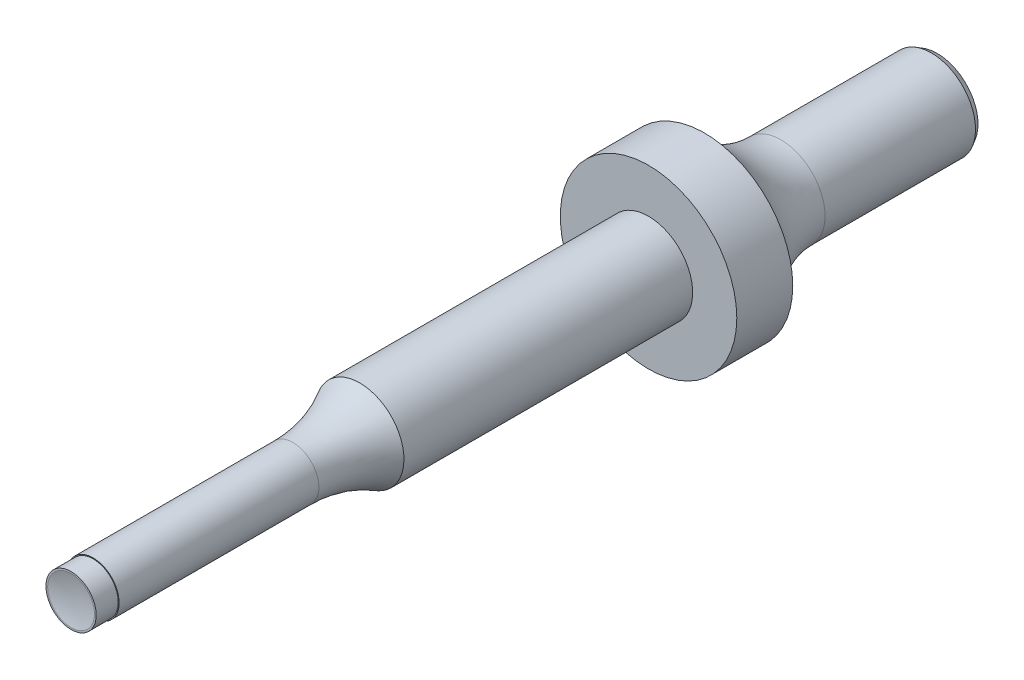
from build123d import *

# Parameters (mm, degrees)
SKETCH1_R           = 5.095
BOSS_EXTRUDE1_DEPTH = 100
SKETCH2_OUTSIDE_W   = 32.396
SKETCH2_OUTSIDE_H   = 32.396
SKETCH2_OUTSIDE_R   = 3
CUT_EXTRUDE1_DEPTH  = 33.333333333
SKETCH3_OUTSIDE_W   = 32.396
SKETCH3_OUTSIDE_H   = 32.396
SKETCH3_OUTSIDE_R   = 2.9
CUT_EXTRUDE2_DEPTH  = 2.5475
CHAMFER1_SIZE       = 0.679333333
CHAMFER1_SIZE2      = 0.392213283


with BuildPart() as part:
    # Sketch1 → Boss-Extrude1 (new body)
    with BuildSketch(Plane.XY):
        Circle(SKETCH1_R)
    extrude(amount=-BOSS_EXTRUDE1_DEPTH)

    # Sketch2 outside → Cut-Extrude1 (cut)
    with BuildSketch(Plane.XY):
        Rectangle(SKETCH2_OUTSIDE_W, SKETCH2_OUTSIDE_H)
        Circle(SKETCH2_OUTSIDE_R, mode=Mode.SUBTRACT)
    extrude(amount=-CUT_EXTRUDE1_DEPTH, mode=Mode.SUBTRACT)

    # Sketch3 outside → Cut-Extrude2 (cut)
    with BuildSketch(Plane.XY):
        Rectangle(SKETCH3_OUTSIDE_W, SKETCH3_OUTSIDE_H)
        Circle(SKETCH3_OUTSIDE_R, mode=Mode.SUBTRACT)
    extrude(amount=-CUT_EXTRUDE2_DEPTH, mode=Mode.SUBTRACT)

    # Sketch4 → Cut-Revolve1 (revolve, cut)
    with BuildSketch(Plane(origin=(0, 0, 0), x_dir=(0, 0, -1), z_dir=(1, 0, 0)), mode=Mode.PRIVATE) as cut_revolve1_sk:
        with BuildLine():
            Line((0, 0), (0, 2.7))
            ThreePointArc((0, 2.7), (0.272748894, 1.362227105), (0.3642125, 0))
            Line((0.3642125, 0), (0, 0))
        make_face()
    revolve(cut_revolve1_sk.sketch.rotate(Axis((0, 0, 0), (0, 0, -1)), 180), axis=Axis((0, 0, 0), (0, 0, -1)), mode=Mode.SUBTRACT)

    # Chamfer1
    chamfer1_edges = [part.edges().sort_by_distance(p)[0] for p in [
        (-5.095, 0, -100),
    ]]
    chamfer1_side = [part.faces().sort_by_distance(p)[0] for p in [
        (-5.095, 0, -66.666666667),
    ]]
    chamfer(chamfer1_edges, length=CHAMFER1_SIZE, length2=CHAMFER1_SIZE2, reference=chamfer1_side[0])

    # Sketch5 → Revolve1 (revolve)
    with BuildSketch(Plane(origin=(0, 0, 0), x_dir=(0, 0, -1), z_dir=(1, 0, 0)), mode=Mode.PRIVATE) as revolve1_sk:
        with BuildLine():
            Line((33.333333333, 0), (25.609660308, 0))
            Line((25.609660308, 0), (25.609660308, 3))
            ThreePointArc((25.609660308, 3), (29.611039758, 3.533044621), (33.333333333, 5.095))
            Line((33.333333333, 5.095), (33.333333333, 0))
        make_face()
    revolve(revolve1_sk.sketch.rotate(Axis((0, 0, -33.333333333), (0, 0, 1)), 270), axis=Axis((0, 0, -33.333333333), (0, 0, 1)))

    # Sketch6 → Revolve2 (revolve)
    with BuildSketch(Plane(origin=(0, 0, 0), x_dir=(0, 0, -1), z_dir=(1, 0, 0)), mode=Mode.PRIVATE) as revolve2_sk:
        with BuildLine():
            Line((66.666666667, 0), (81.951666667, 0))
            Line((81.951666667, 0), (81.951666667, 5.095))
            ThreePointArc((81.951666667, 5.095), (76.856666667, 6.460201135), (73.126867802, 10.19))
            Line((73.126867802, 10.19), (66.666666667, 10.19))
            Line((66.666666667, 10.19), (66.666666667, 0))
        make_face()
    revolve(revolve2_sk.sketch.rotate(Axis((0, 0, -66.666666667), (0, 0, -1)), 90), axis=Axis((0, 0, -66.666666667), (0, 0, -1)))


solid = part.part
